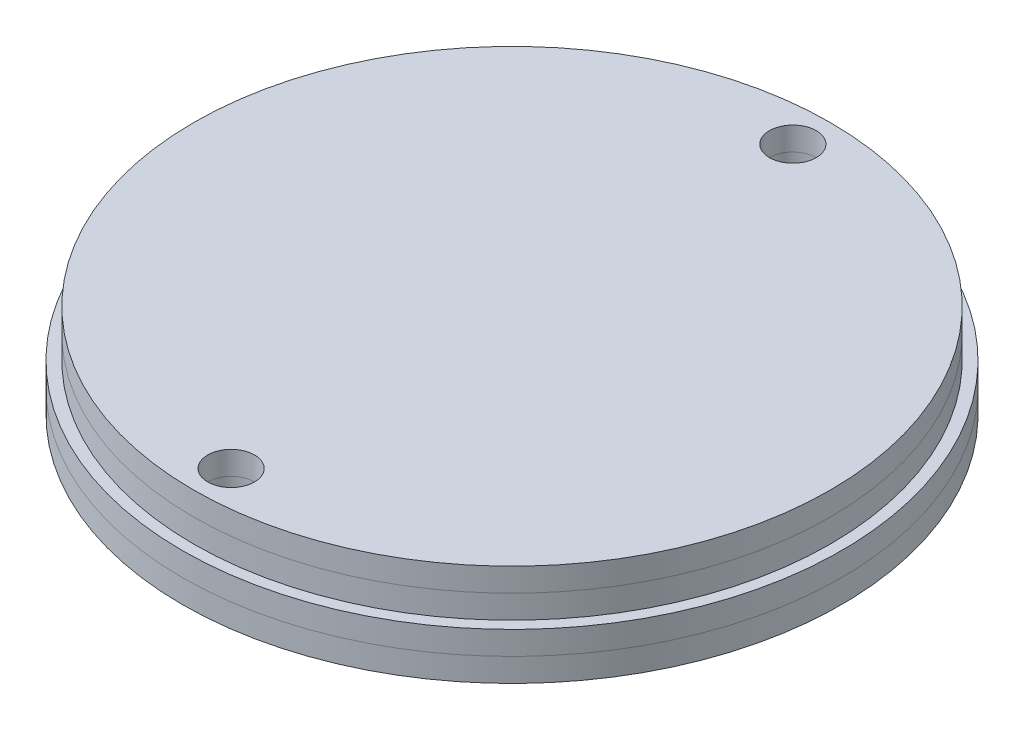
from build123d import *

# Parameters (mm, degrees)
SKETCH1_R           = 43.18
BOSS_EXTRUDE1_DEPTH = 3.175
SKETCH6_R           = 43.18
BOSS_EXTRUDE3_DEPTH = 3.175
SKETCH2_R           = 44.704
BOSS_EXTRUDE2_DEPTH = 3.175
SKETCH7_R           = 44.704
BOSS_EXTRUDE4_DEPTH = 3.175
SKETCH5_R           = 3.175
CUT_EXTRUDE2_DEPTH  = 64.934504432


with BuildPart() as part:
    # Sketch1 → Boss-Extrude1 (new body)
    with BuildSketch(Plane(origin=(0, 0, 0), x_dir=(1, 0, 0), z_dir=(0, 1, 0))):
        with Locations(Location((0, 0, 0), (0, 0, 270))):
            Circle(SKETCH1_R)
    extrude(amount=BOSS_EXTRUDE1_DEPTH)

    # Sketch2 → Boss-Extrude2 (add)
    with BuildSketch(Plane(origin=(0, 0, 0), x_dir=(1, 0, 0), z_dir=(0, 1, 0))):
        with Locations(Location((0, 0, 0), (0, 0, 270))):
            Circle(SKETCH2_R)
    extrude(amount=-BOSS_EXTRUDE2_DEPTH)


with BuildPart() as body_2:
    # Sketch6 → Boss-Extrude3 (new body)
    with BuildSketch(Plane(origin=(0, 3.175, 0), x_dir=(1, 0, 0), z_dir=(0, 1, 0))):
        with Locations(Location((0, 0, 0), (0, 0, 270))):
            Circle(SKETCH6_R)
    extrude(amount=BOSS_EXTRUDE3_DEPTH)


with BuildPart() as body_3:
    # Sketch7 → Boss-Extrude4 (new body)
    with BuildSketch(Plane.XZ.offset(3.175)):
        with Locations(Location((0, 0, 0), (0, 0, 270))):
            Circle(SKETCH7_R)
    extrude(amount=BOSS_EXTRUDE4_DEPTH)


with BuildPart() as cut_extrude2_tool:
    # Sketch5 → Cut-Extrude2 (new, symmetric)
    with BuildSketch(Plane(origin=(0, 3.175, 0), x_dir=(1, 0, 0), z_dir=(0, 1, 0))):
        with Locations(Location((0, 38.1, 0), (0, 0, 270))):
            Circle(SKETCH5_R)
    cut_extrude2 = extrude(amount=CUT_EXTRUDE2_DEPTH, both=True)


with BuildPart() as part_1:
    add(part.part)

    # Cut-Extrude2: cut by cut_extrude2_tool
    add(cut_extrude2_tool.part, mode=Mode.SUBTRACT)


with BuildPart() as body_2_1:
    add(body_2.part)

    # Cut-Extrude2: cut by cut_extrude2_tool
    add(cut_extrude2_tool.part, mode=Mode.SUBTRACT)


with BuildPart() as body_3_1:
    add(body_3.part)

    # Cut-Extrude2: cut by cut_extrude2_tool
    add(cut_extrude2_tool.part, mode=Mode.SUBTRACT)


with BuildPart() as mirror1_tool:
    # Mirror1: Cut-Extrude2 across plane
    add(cut_extrude2.mirror(Plane.XY))


with BuildPart() as part_2:
    add(part_1.part)

    # Mirror1: cut by mirror1_tool
    add(mirror1_tool.part, mode=Mode.SUBTRACT)


with BuildPart() as body_2_2:
    add(body_2_1.part)

    # Mirror1: cut by mirror1_tool
    add(mirror1_tool.part, mode=Mode.SUBTRACT)


with BuildPart() as body_3_2:
    add(body_3_1.part)

    # Mirror1: cut by mirror1_tool
    add(mirror1_tool.part, mode=Mode.SUBTRACT)


solid = Compound([part_2.part, body_2_2.part, body_3_2.part])
